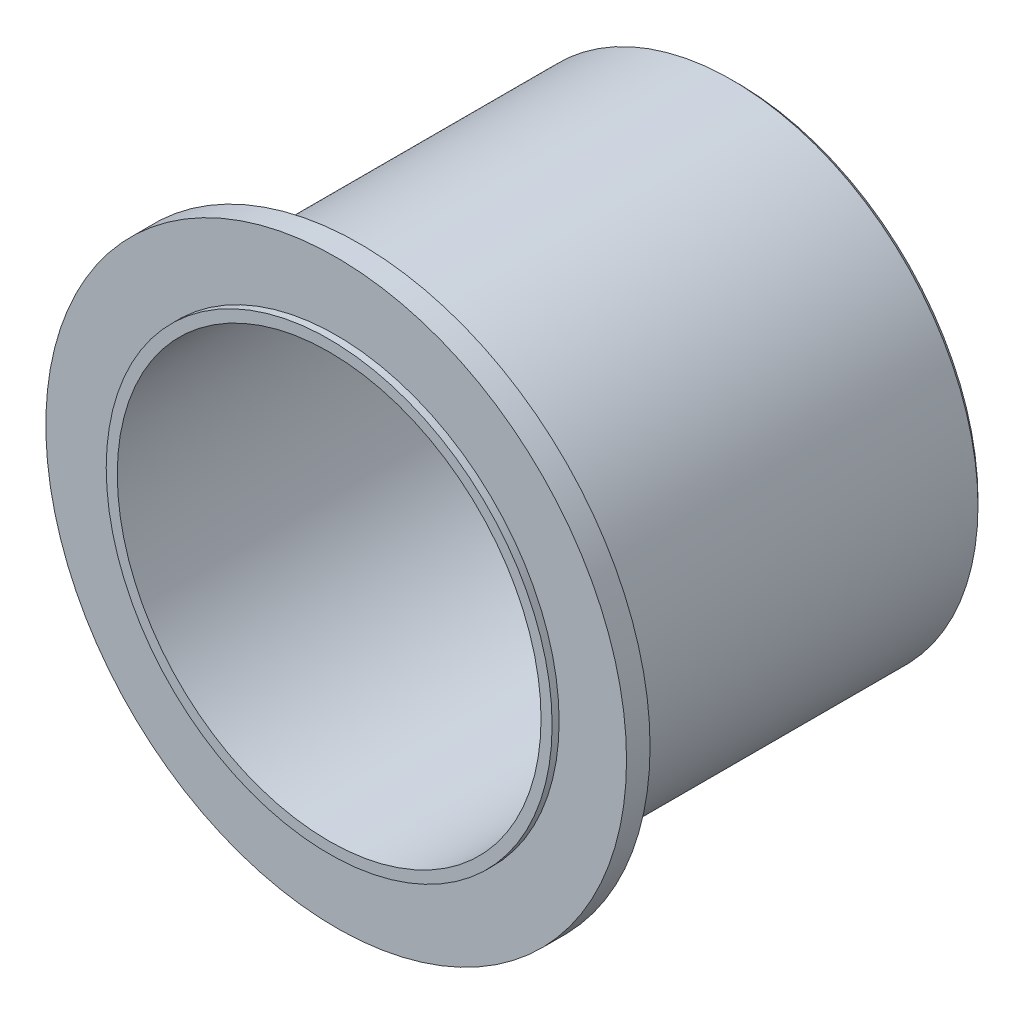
from build123d import *

# Parameters (mm, degrees)
IZIM2_R               = 30.175
KES_EKSTR_ZYON1_DEPTH = 58.15
PAH1_SIZE             = 0.75
PAH2_SIZE             = 3
PAH2_SIZE2            = 5.196152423
RADYUS1_R             = 3


with BuildPart() as part:
    # izim1 → D_nd_r1 (revolve)
    with BuildSketch(Plane(origin=(0, 0, 0), x_dir=(1, 0, 0), z_dir=(0, 1, 0)), mode=Mode.PRIVATE) as d_nd_r1_sk:
        Polygon((0, 0), (0, 58.15), (-35, 58.15), (-35, 7.35), (-41.35, 7.35), (-41.35, 1), (-31.75, 1), (-31.75, 0), align=None)
    revolve(d_nd_r1_sk.sketch.rotate(Axis((0, 0, 0), (0, 0, -1)), 180), axis=Axis((0, 0, 0), (0, 0, -1)))

    # izim2 → Kes-Ekstr_zyon1 (cut)
    with BuildSketch(Plane(origin=(0, 0, -58.15), x_dir=(-1, 0, 0), z_dir=(0, 0, -1))):
        Circle(IZIM2_R)
    extrude(amount=-KES_EKSTR_ZYON1_DEPTH, mode=Mode.SUBTRACT)

    # Pah1
    pah1_edges = [part.edges().sort_by_distance(p)[0] for p in [
        (-35, 0, -7.35),
        (-35, 0, -58.15),
    ]]
    chamfer(pah1_edges, length=PAH1_SIZE)

    # Pah2
    pah2_edges = [part.edges().sort_by_distance(p)[0] for p in [
        (-41.35, 0, -7.35),
    ]]
    pah2_side = [part.faces().sort_by_distance(p)[0] for p in [
        (-41.35, 0, -4.175),
    ]]
    chamfer(pah2_edges, length=PAH2_SIZE, length2=PAH2_SIZE2, reference=pah2_side[0])

    # Radyus1
    radyus1_edges = [part.edges().sort_by_distance(p)[0] for p in [
        (30.175, 0, -58.15),
    ]]
    fillet(radyus1_edges, radius=RADYUS1_R)


solid = part.part
